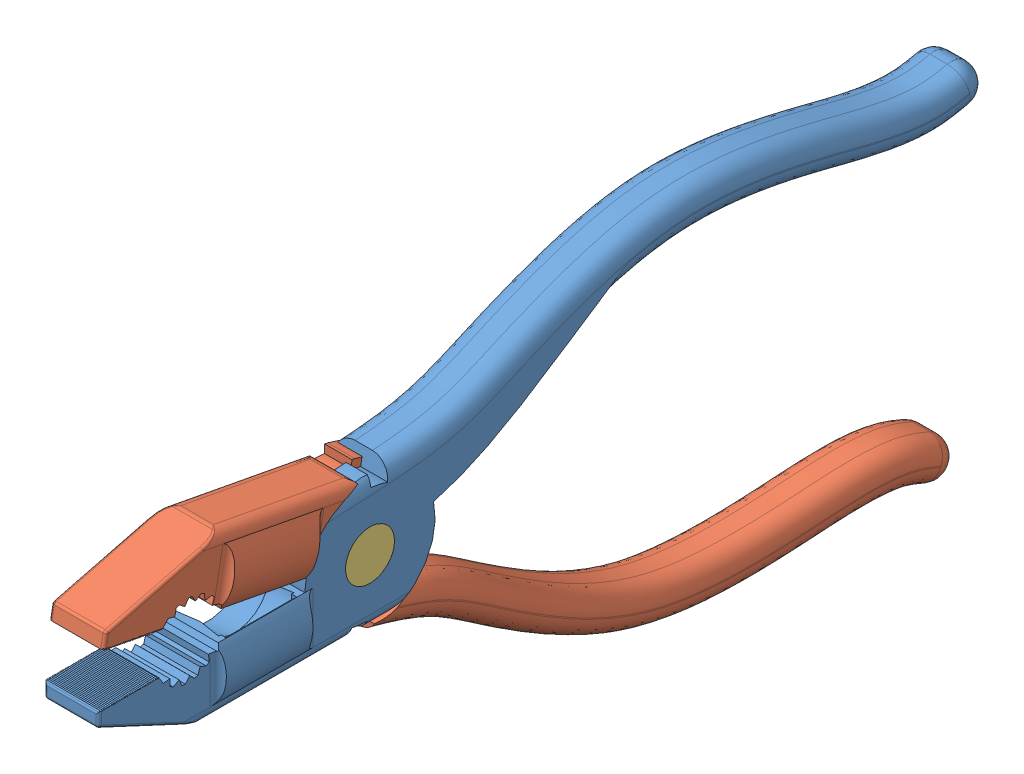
SolidWorks assembly Assem1 Alicates.SLDASM, configuration Predeterminado (file format 4400). Lengths in mm.
Overall size (32.28 103.76 170.98).
3 component instances, 3 part files, 4 mates.
Components (placement in the parent):
- Alicates 1-1: Alicates 1.SLDPRT [Predeterminado] at (1.5535 7.3801 0) size (32.26 53.66 163.86)
- Alicates 2-1: Alicates 2.SLDPRT [Predeterminado] at (1.5535 7.3801 0) x (-1 0 0) z (0 0.185658 0.982614) size (32.28 53.67 163.86)
- Eix-1: Eix.SLDPRT [Predeterminado] at (6.5535 7.3801 0) x (0 0.435242 0.900314) z (-1 0 0) size (9 9 10)
Mates (geometry in assembly coordinates):
- Coincidente2: coincident anti-aligned: plane of Alicates 1-1 through (1.5535 7.3801 0) normal (-1 0 0); plane of Alicates 2-1 through (1.5535 7.3801 0) normal (1 0 0)
- Concéntrica1: concentric anti-aligned: cylinder of Alicates 1-1 through (6.5535 7.3801 0) axis (-1 0 0) radius 4.5; cylinder of Eix-1 through (-3.4465 7.3801 0) axis (1 0 0) radius 4.5
- Coincidente3: coincident aligned: plane of Alicates 1-1 through (6.5535 7.3801 0) normal (1 0 0); plane of Eix-1 through (6.5535 7.3801 0) normal (1 0 0)
- Concéntrica2: concentric aligned: cylinder of Alicates 2-1 through (-3.4465 7.3801 0) axis (1 0 0) radius 4.5; cylinder of Eix-1 through (-3.4465 7.3801 0) axis (1 0 0) radius 4.5
